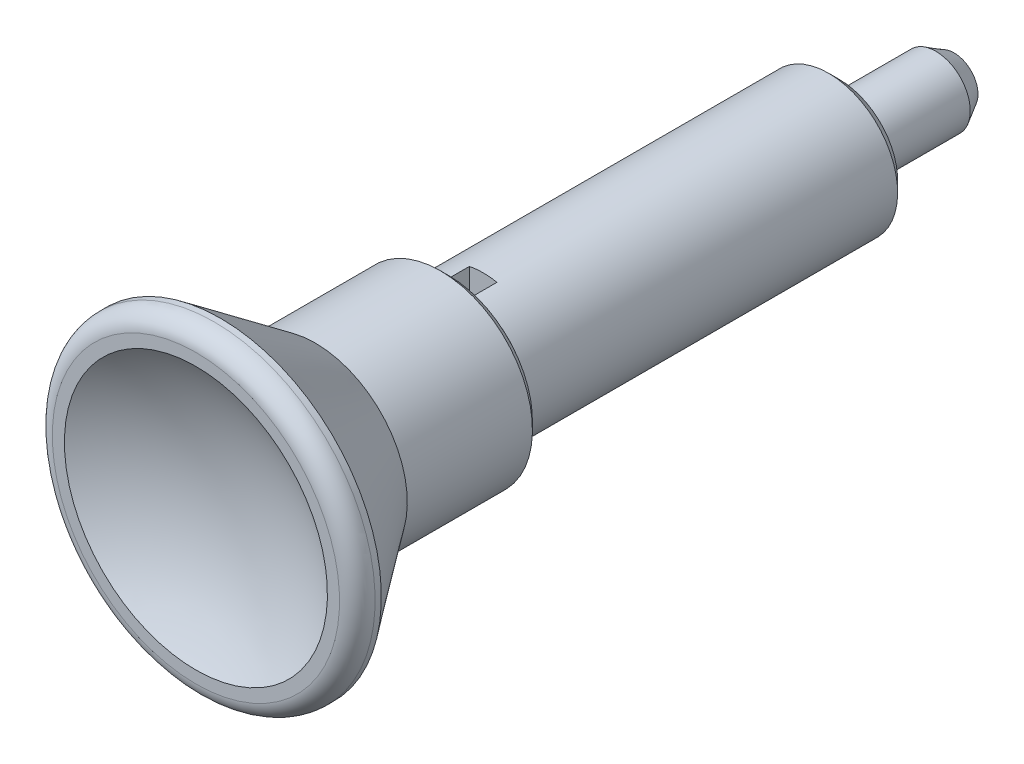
ISO-10303-21;
HEADER;
FILE_DESCRIPTION(('STEP AP214'),'2;1');
FILE_NAME('part.step','',(''),(''),'','','');
FILE_SCHEMA(('AUTOMOTIVE_DESIGN { 1 0 10303 214 1 1 1 1 }'));
ENDSEC;
DATA;
#1=APPLICATION_CONTEXT('core data for automotive mechanical design processes');
#2=APPLICATION_PROTOCOL_DEFINITION('international standard','automotive_design',2000,#1);
#3=PRODUCT_CONTEXT('',#1,'mechanical');
#4=PRODUCT('Part','Part','',(#3));
#5=PRODUCT_RELATED_PRODUCT_CATEGORY('part','',(#4));
#6=PRODUCT_DEFINITION_FORMATION('','',#4);
#7=PRODUCT_DEFINITION_CONTEXT('part definition',#1,'design');
#8=PRODUCT_DEFINITION('design','',#6,#7);
#9=PRODUCT_DEFINITION_SHAPE('','',#8);
#10=(LENGTH_UNIT() NAMED_UNIT(*) SI_UNIT(.MILLI.,.METRE.));
#11=(NAMED_UNIT(*) PLANE_ANGLE_UNIT() SI_UNIT($,.RADIAN.));
#12=(NAMED_UNIT(*) SI_UNIT($,.STERADIAN.) SOLID_ANGLE_UNIT());
#13=UNCERTAINTY_MEASURE_WITH_UNIT(LENGTH_MEASURE(1.E-05),#10,'distance_accuracy_value','');
#14=(GEOMETRIC_REPRESENTATION_CONTEXT(3) GLOBAL_UNCERTAINTY_ASSIGNED_CONTEXT((#13)) GLOBAL_UNIT_ASSIGNED_CONTEXT((#10,
#11,#12)) REPRESENTATION_CONTEXT('',''));
#15=CARTESIAN_POINT('',(0.,0.,0.));
#16=DIRECTION('',(0.,0.,1.));
#17=DIRECTION('',(1.,0.,0.));
#18=AXIS2_PLACEMENT_3D('',#15,#16,#17);
#19=CARTESIAN_POINT('',(0.6,8.,15.5));
#20=DIRECTION('',(0.,0.,1.));
#21=DIRECTION('',(0.,1.,0.));
#22=AXIS2_PLACEMENT_3D('',#19,#20,#21);
#23=PLANE('',#22);
#24=DIRECTION('',(0.,-1.,0.));
#25=VECTOR('',#24,1.);
#26=CARTESIAN_POINT('',(0.6,8.,15.5));
#27=LINE('',#26,#25);
#28=CARTESIAN_POINT('',(0.6,2.93938769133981,15.5));
#29=VERTEX_POINT('',#28);
#30=CARTESIAN_POINT('',(0.6,1.37477270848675,15.5));
#31=VERTEX_POINT('',#30);
#32=EDGE_CURVE('E83',#29,#31,#27,.T.);
#33=ORIENTED_EDGE('',*,*,#32,.F.);
#34=CARTESIAN_POINT('',(0.,0.,15.5));
#35=DIRECTION('',(0.,0.,1.));
#36=DIRECTION('',(0.,1.,0.));
#37=AXIS2_PLACEMENT_3D('',#34,#35,#36);
#38=CIRCLE('',#37,3.);
#39=CARTESIAN_POINT('',(-0.6,2.93938769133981,15.5));
#40=VERTEX_POINT('',#39);
#41=EDGE_CURVE('E77',#40,#29,#38,.F.);
#42=ORIENTED_EDGE('',*,*,#41,.F.);
#43=DIRECTION('',(0.,1.,0.));
#44=VECTOR('',#43,1.);
#45=CARTESIAN_POINT('',(-0.6,8.,15.5));
#46=LINE('',#45,#44);
#47=CARTESIAN_POINT('',(-0.6,1.37477270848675,15.5));
#48=VERTEX_POINT('',#47);
#49=EDGE_CURVE('E80',#48,#40,#46,.T.);
#50=ORIENTED_EDGE('',*,*,#49,.F.);
#51=CARTESIAN_POINT('',(0.,0.,15.5));
#52=DIRECTION('',(0.,0.,1.));
#53=DIRECTION('',(0.,1.,0.));
#54=AXIS2_PLACEMENT_3D('',#51,#52,#53);
#55=CIRCLE('',#54,1.5);
#56=EDGE_CURVE('E102',#31,#48,#55,.T.);
#57=ORIENTED_EDGE('',*,*,#56,.F.);
#58=EDGE_LOOP('',(#33,#42,#50,#57));
#59=FACE_BOUND('',#58,.T.);
#60=ADVANCED_FACE('F14',(#59),#23,.T.);
#61=CARTESIAN_POINT('',(0.6,8.,15.5));
#62=DIRECTION('',(0.,0.,1.));
#63=DIRECTION('',(0.,1.,0.));
#64=AXIS2_PLACEMENT_3D('',#61,#62,#63);
#65=PLANE('',#64);
#66=DIRECTION('',(0.,1.,0.));
#67=VECTOR('',#66,1.);
#68=CARTESIAN_POINT('',(-0.6,8.,15.5));
#69=LINE('',#68,#67);
#70=CARTESIAN_POINT('',(-0.6,-2.93938769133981,15.5));
#71=VERTEX_POINT('',#70);
#72=CARTESIAN_POINT('',(-0.6,-1.37477270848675,15.5));
#73=VERTEX_POINT('',#72);
#74=EDGE_CURVE('E210',#71,#73,#69,.T.);
#75=ORIENTED_EDGE('',*,*,#74,.F.);
#76=CARTESIAN_POINT('',(0.,0.,15.5));
#77=DIRECTION('',(0.,0.,1.));
#78=DIRECTION('',(0.,1.,0.));
#79=AXIS2_PLACEMENT_3D('',#76,#77,#78);
#80=CIRCLE('',#79,3.);
#81=CARTESIAN_POINT('',(0.6,-2.93938769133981,15.5));
#82=VERTEX_POINT('',#81);
#83=EDGE_CURVE('E86',#82,#71,#80,.F.);
#84=ORIENTED_EDGE('',*,*,#83,.F.);
#85=DIRECTION('',(0.,-1.,0.));
#86=VECTOR('',#85,1.);
#87=CARTESIAN_POINT('',(0.6,8.,15.5));
#88=LINE('',#87,#86);
#89=CARTESIAN_POINT('',(0.6,-1.37477270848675,15.5));
#90=VERTEX_POINT('',#89);
#91=EDGE_CURVE('E228',#90,#82,#88,.T.);
#92=ORIENTED_EDGE('',*,*,#91,.F.);
#93=CARTESIAN_POINT('',(0.,0.,15.5));
#94=DIRECTION('',(0.,0.,1.));
#95=DIRECTION('',(0.,1.,0.));
#96=AXIS2_PLACEMENT_3D('',#93,#94,#95);
#97=CIRCLE('',#96,1.5);
#98=EDGE_CURVE('E214',#73,#90,#97,.T.);
#99=ORIENTED_EDGE('',*,*,#98,.F.);
#100=EDGE_LOOP('',(#75,#84,#92,#99));
#101=FACE_BOUND('',#100,.T.);
#102=ADVANCED_FACE('F253',(#101),#65,.T.);
#103=CARTESIAN_POINT('',(0.,0.,0.));
#104=DIRECTION('',(0.,0.,1.));
#105=DIRECTION('',(0.,1.,0.));
#106=AXIS2_PLACEMENT_3D('',#103,#104,#105);
#107=CYLINDRICAL_SURFACE('',#106,3.);
#108=DIRECTION('',(0.,0.,1.));
#109=VECTOR('',#108,1.);
#110=CARTESIAN_POINT('',(0.6,-2.93938769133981,17.));
#111=LINE('',#110,#109);
#112=CARTESIAN_POINT('',(0.6,-2.93938769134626,16.5400000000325));
#113=VERTEX_POINT('',#112);
#114=EDGE_CURVE('E231',#82,#113,#111,.T.);
#115=ORIENTED_EDGE('',*,*,#114,.F.);
#116=ORIENTED_EDGE('',*,*,#83,.T.);
#117=DIRECTION('',(0.,0.,1.));
#118=VECTOR('',#117,1.);
#119=CARTESIAN_POINT('',(-0.6,-2.93938769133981,15.5));
#120=LINE('',#119,#118);
#121=CARTESIAN_POINT('',(-0.6,-2.93938769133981,16.5400000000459));
#122=VERTEX_POINT('',#121);
#123=EDGE_CURVE('E209',#122,#71,#120,.F.);
#124=ORIENTED_EDGE('',*,*,#123,.F.);
#125=CARTESIAN_POINT('',(0.,0.,16.5400000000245));
#126=DIRECTION('',(0.,0.,-1.));
#127=DIRECTION('',(0.,-1.,0.));
#128=AXIS2_PLACEMENT_3D('',#125,#126,#127);
#129=CIRCLE('',#128,2.99999999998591);
#130=CARTESIAN_POINT('',(-0.6,2.93938769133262,16.5400000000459));
#131=VERTEX_POINT('',#130);
#132=EDGE_CURVE('E98',#131,#122,#129,.F.);
#133=ORIENTED_EDGE('',*,*,#132,.F.);
#134=DIRECTION('',(0.,0.,1.));
#135=VECTOR('',#134,1.);
#136=CARTESIAN_POINT('',(-0.6,2.93938769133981,15.5));
#137=LINE('',#136,#135);
#138=EDGE_CURVE('E91',#40,#131,#137,.T.);
#139=ORIENTED_EDGE('',*,*,#138,.F.);
#140=ORIENTED_EDGE('',*,*,#41,.T.);
#141=DIRECTION('',(0.,0.,1.));
#142=VECTOR('',#141,1.);
#143=CARTESIAN_POINT('',(0.6,2.93938769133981,17.));
#144=LINE('',#143,#142);
#145=CARTESIAN_POINT('',(0.6,2.93938769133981,16.5400000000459));
#146=VERTEX_POINT('',#145);
#147=EDGE_CURVE('E219',#146,#29,#144,.F.);
#148=ORIENTED_EDGE('',*,*,#147,.F.);
#149=CARTESIAN_POINT('',(0.,0.,16.5400000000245));
#150=DIRECTION('',(0.,0.,-1.));
#151=DIRECTION('',(0.,-1.,0.));
#152=AXIS2_PLACEMENT_3D('',#149,#150,#151);
#153=CIRCLE('',#152,2.99999999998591);
#154=EDGE_CURVE('E233',#113,#146,#153,.F.);
#155=ORIENTED_EDGE('',*,*,#154,.F.);
#156=EDGE_LOOP('',(#115,#116,#124,#133,#139,#140,#148,#155));
#157=FACE_BOUND('',#156,.T.);
#158=CARTESIAN_POINT('',(0.,0.,0.46));
#159=DIRECTION('',(0.,0.,1.));
#160=DIRECTION('',(0.,1.,0.));
#161=AXIS2_PLACEMENT_3D('',#158,#159,#160);
#162=CIRCLE('',#161,3.);
#163=CARTESIAN_POINT('',(0.,3.,0.46));
#164=VERTEX_POINT('',#163);
#165=EDGE_CURVE('E87',#164,#164,#162,.T.);
#166=ORIENTED_EDGE('',*,*,#165,.T.);
#167=EDGE_LOOP('',(#166));
#168=FACE_BOUND('',#167,.T.);
#169=ADVANCED_FACE('F93',(#157,#168),#107,.T.);
#170=CARTESIAN_POINT('',(-0.6,8.,15.5));
#171=DIRECTION('',(1.,0.,0.));
#172=DIRECTION('',(0.,1.,0.));
#173=AXIS2_PLACEMENT_3D('',#170,#171,#172);
#174=PLANE('',#173);
#175=ORIENTED_EDGE('',*,*,#138,.T.);
#176=CARTESIAN_POINT('',(-0.6,2.46811669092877,17.0000000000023));
#177=CARTESIAN_POINT('',(-0.6,2.54681970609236,16.9234950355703));
#178=CARTESIAN_POINT('',(-0.6,2.62544380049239,16.8469092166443));
#179=CARTESIAN_POINT('',(-0.6,2.78253413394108,16.6935758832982));
#180=CARTESIAN_POINT('',(-0.6,2.86100037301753,16.6168283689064));
#181=CARTESIAN_POINT('',(-0.6,2.9393876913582,16.5400000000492));
#182=B_SPLINE_CURVE_WITH_KNOTS('',3,(#176,#177,#178,#179,#180,#181),.UNSPECIFIED.,.F.,.F.,(4,2,
4),(0.,0.329278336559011,0.658556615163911),.UNSPECIFIED.);
#183=CARTESIAN_POINT('',(-0.6,2.46811669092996,17.0000000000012));
#184=VERTEX_POINT('',#183);
#185=EDGE_CURVE('E222',#184,#131,#182,.T.);
#186=ORIENTED_EDGE('',*,*,#185,.F.);
#187=DIRECTION('',(0.,1.,0.));
#188=VECTOR('',#187,1.);
#189=CARTESIAN_POINT('',(-0.6,0.,17.));
#190=LINE('',#189,#188);
#191=CARTESIAN_POINT('',(-0.6,1.37477270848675,17.));
#192=VERTEX_POINT('',#191);
#193=EDGE_CURVE('E204',#184,#192,#190,.F.);
#194=ORIENTED_EDGE('',*,*,#193,.T.);
#195=DIRECTION('',(0.,0.,1.));
#196=VECTOR('',#195,1.);
#197=CARTESIAN_POINT('',(-0.6,1.37477270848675,-5.));
#198=LINE('',#197,#196);
#199=EDGE_CURVE('E107',#48,#192,#198,.T.);
#200=ORIENTED_EDGE('',*,*,#199,.F.);
#201=ORIENTED_EDGE('',*,*,#49,.T.);
#202=EDGE_LOOP('',(#175,#186,#194,#200,#201));
#203=FACE_BOUND('',#202,.T.);
#204=ADVANCED_FACE('F104',(#203),#174,.T.);
#205=CARTESIAN_POINT('',(0.,0.,-5.));
#206=DIRECTION('',(0.,0.,1.));
#207=DIRECTION('',(0.,1.,0.));
#208=AXIS2_PLACEMENT_3D('',#205,#206,#207);
#209=CYLINDRICAL_SURFACE('',#208,1.5);
#210=ORIENTED_EDGE('',*,*,#199,.T.);
#211=CARTESIAN_POINT('',(0.,0.,17.));
#212=DIRECTION('',(0.,0.,1.));
#213=DIRECTION('',(0.,1.,0.));
#214=AXIS2_PLACEMENT_3D('',#211,#212,#213);
#215=CIRCLE('',#214,1.5);
#216=CARTESIAN_POINT('',(0.6,1.37477270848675,17.));
#217=VERTEX_POINT('',#216);
#218=EDGE_CURVE('E203',#192,#217,#215,.F.);
#219=ORIENTED_EDGE('',*,*,#218,.T.);
#220=DIRECTION('',(0.,0.,1.));
#221=VECTOR('',#220,1.);
#222=CARTESIAN_POINT('',(0.6,1.37477270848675,17.));
#223=LINE('',#222,#221);
#224=EDGE_CURVE('E216',#31,#217,#223,.T.);
#225=ORIENTED_EDGE('',*,*,#224,.F.);
#226=ORIENTED_EDGE('',*,*,#56,.T.);
#227=EDGE_LOOP('',(#210,#219,#225,#226));
#228=FACE_BOUND('',#227,.T.);
#229=ADVANCED_FACE('F281',(#228),#209,.T.);
#230=CARTESIAN_POINT('',(0.6,8.,17.));
#231=DIRECTION('',(-1.,0.,0.));
#232=DIRECTION('',(0.,-1.,0.));
#233=AXIS2_PLACEMENT_3D('',#230,#231,#232);
#234=PLANE('',#233);
#235=CARTESIAN_POINT('',(0.6,2.93938769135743,16.54000000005));
#236=CARTESIAN_POINT('',(0.6,2.8610003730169,16.6168283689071));
#237=CARTESIAN_POINT('',(0.6,2.78253413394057,16.6935758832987));
#238=CARTESIAN_POINT('',(0.6,2.62544380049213,16.8469092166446));
#239=CARTESIAN_POINT('',(0.6,2.54681970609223,16.9234950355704));
#240=CARTESIAN_POINT('',(0.6,2.46811669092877,17.0000000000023));
#241=B_SPLINE_CURVE_WITH_KNOTS('',3,(#235,#236,#237,#238,#239,#240),.UNSPECIFIED.,.F.,.F.,(4,2,
4),(0.,0.329278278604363,0.658556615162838),.UNSPECIFIED.);
#242=CARTESIAN_POINT('',(0.6,2.46811669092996,17.0000000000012));
#243=VERTEX_POINT('',#242);
#244=EDGE_CURVE('E232',#146,#243,#241,.T.);
#245=ORIENTED_EDGE('',*,*,#244,.F.);
#246=ORIENTED_EDGE('',*,*,#147,.T.);
#247=ORIENTED_EDGE('',*,*,#32,.T.);
#248=ORIENTED_EDGE('',*,*,#224,.T.);
#249=DIRECTION('',(0.,1.,0.));
#250=VECTOR('',#249,1.);
#251=CARTESIAN_POINT('',(0.6,0.,17.));
#252=LINE('',#251,#250);
#253=EDGE_CURVE('E201',#217,#243,#252,.T.);
#254=ORIENTED_EDGE('',*,*,#253,.T.);
#255=EDGE_LOOP('',(#245,#246,#247,#248,#254));
#256=FACE_BOUND('',#255,.T.);
#257=ADVANCED_FACE('F239',(#256),#234,.T.);
#258=CARTESIAN_POINT('',(0.,0.,16.5399999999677));
#259=DIRECTION('',(0.,0.,-1.));
#260=DIRECTION('',(0.,-1.,0.));
#261=AXIS2_PLACEMENT_3D('',#258,#259,#260);
#262=CONICAL_SURFACE('',#261,3.00000000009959,0.785398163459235);
#263=ORIENTED_EDGE('',*,*,#244,.T.);
#264=CARTESIAN_POINT('',(0.,0.,17.));
#265=DIRECTION('',(0.,0.,-1.));
#266=DIRECTION('',(0.,-1.,0.));
#267=AXIS2_PLACEMENT_3D('',#264,#265,#266);
#268=CIRCLE('',#267,2.54000000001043);
#269=CARTESIAN_POINT('',(0.6,-2.46811669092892,17.0000000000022));
#270=VERTEX_POINT('',#269);
#271=EDGE_CURVE('E200',#243,#270,#268,.T.);
#272=ORIENTED_EDGE('',*,*,#271,.T.);
#273=CARTESIAN_POINT('',(0.599999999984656,-2.93938769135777,16.540000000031));
#274=CARTESIAN_POINT('',(0.599999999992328,-2.86100037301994,16.6168283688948));
#275=CARTESIAN_POINT('',(0.599999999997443,-2.78253413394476,16.6935758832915));
#276=CARTESIAN_POINT('',(0.600000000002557,-2.62544380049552,16.8469092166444));
#277=CARTESIAN_POINT('',(0.600000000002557,-2.54681970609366,16.9234950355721));
#278=CARTESIAN_POINT('',(0.6,-2.46811669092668,17.0000000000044));
#279=B_SPLINE_CURVE_WITH_KNOTS('',3,(#273,#274,#275,#276,#277,#278),.UNSPECIFIED.,.F.,.F.,(4,2,
4),(0.,0.32927827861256,0.658556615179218),.UNSPECIFIED.);
#280=EDGE_CURVE('E215',#113,#270,#279,.T.);
#281=ORIENTED_EDGE('',*,*,#280,.F.);
#282=ORIENTED_EDGE('',*,*,#154,.T.);
#283=EDGE_LOOP('',(#263,#272,#281,#282));
#284=FACE_BOUND('',#283,.T.);
#285=ADVANCED_FACE('F244',(#284),#262,.T.);
#286=CARTESIAN_POINT('',(0.6,8.,17.));
#287=DIRECTION('',(-1.,0.,0.));
#288=DIRECTION('',(0.,-1.,0.));
#289=AXIS2_PLACEMENT_3D('',#286,#287,#288);
#290=PLANE('',#289);
#291=ORIENTED_EDGE('',*,*,#114,.T.);
#292=ORIENTED_EDGE('',*,*,#280,.T.);
#293=DIRECTION('',(0.,1.,0.));
#294=VECTOR('',#293,1.);
#295=CARTESIAN_POINT('',(0.6,0.,17.));
#296=LINE('',#295,#294);
#297=CARTESIAN_POINT('',(0.6,-1.37477270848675,17.));
#298=VERTEX_POINT('',#297);
#299=EDGE_CURVE('E197',#270,#298,#296,.T.);
#300=ORIENTED_EDGE('',*,*,#299,.T.);
#301=DIRECTION('',(0.,0.,1.));
#302=VECTOR('',#301,1.);
#303=CARTESIAN_POINT('',(0.6,-1.37477270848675,-5.));
#304=LINE('',#303,#302);
#305=EDGE_CURVE('E211',#90,#298,#304,.T.);
#306=ORIENTED_EDGE('',*,*,#305,.F.);
#307=ORIENTED_EDGE('',*,*,#91,.T.);
#308=EDGE_LOOP('',(#291,#292,#300,#306,#307));
#309=FACE_BOUND('',#308,.T.);
#310=ADVANCED_FACE('F249',(#309),#290,.T.);
#311=CARTESIAN_POINT('',(0.,0.,-5.));
#312=DIRECTION('',(0.,0.,1.));
#313=DIRECTION('',(0.,1.,0.));
#314=AXIS2_PLACEMENT_3D('',#311,#312,#313);
#315=CYLINDRICAL_SURFACE('',#314,1.5);
#316=DIRECTION('',(0.,0.,1.));
#317=VECTOR('',#316,1.);
#318=CARTESIAN_POINT('',(-0.6,-1.37477270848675,15.5));
#319=LINE('',#318,#317);
#320=CARTESIAN_POINT('',(-0.6,-1.37477270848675,17.));
#321=VERTEX_POINT('',#320);
#322=EDGE_CURVE('E207',#73,#321,#319,.T.);
#323=ORIENTED_EDGE('',*,*,#322,.F.);
#324=ORIENTED_EDGE('',*,*,#98,.T.);
#325=ORIENTED_EDGE('',*,*,#305,.T.);
#326=CARTESIAN_POINT('',(0.,0.,17.));
#327=DIRECTION('',(0.,0.,1.));
#328=DIRECTION('',(0.,1.,0.));
#329=AXIS2_PLACEMENT_3D('',#326,#327,#328);
#330=CIRCLE('',#329,1.5);
#331=EDGE_CURVE('E196',#298,#321,#330,.F.);
#332=ORIENTED_EDGE('',*,*,#331,.T.);
#333=EDGE_LOOP('',(#323,#324,#325,#332));
#334=FACE_BOUND('',#333,.T.);
#335=ADVANCED_FACE('F422',(#334),#315,.T.);
#336=CARTESIAN_POINT('',(-0.6,8.,15.5));
#337=DIRECTION('',(1.,0.,0.));
#338=DIRECTION('',(0.,1.,0.));
#339=AXIS2_PLACEMENT_3D('',#336,#337,#338);
#340=PLANE('',#339);
#341=CARTESIAN_POINT('',(-0.6,-2.9393876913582,16.5400000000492));
#342=CARTESIAN_POINT('',(-0.6,-2.86100037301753,16.6168283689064));
#343=CARTESIAN_POINT('',(-0.6,-2.78253413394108,16.6935758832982));
#344=CARTESIAN_POINT('',(-0.6,-2.62544380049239,16.8469092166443));
#345=CARTESIAN_POINT('',(-0.6,-2.54681970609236,16.9234950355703));
#346=CARTESIAN_POINT('',(-0.6,-2.46811669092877,17.0000000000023));
#347=B_SPLINE_CURVE_WITH_KNOTS('',3,(#341,#342,#343,#344,#345,#346),.UNSPECIFIED.,.F.,.F.,(4,2,
4),(0.,0.329278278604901,0.658556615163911),.UNSPECIFIED.);
#348=CARTESIAN_POINT('',(-0.6,-2.46811669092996,17.0000000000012));
#349=VERTEX_POINT('',#348);
#350=EDGE_CURVE('E225',#122,#349,#347,.T.);
#351=ORIENTED_EDGE('',*,*,#350,.F.);
#352=ORIENTED_EDGE('',*,*,#123,.T.);
#353=ORIENTED_EDGE('',*,*,#74,.T.);
#354=ORIENTED_EDGE('',*,*,#322,.T.);
#355=DIRECTION('',(0.,1.,0.));
#356=VECTOR('',#355,1.);
#357=CARTESIAN_POINT('',(-0.6,0.,17.));
#358=LINE('',#357,#356);
#359=EDGE_CURVE('E33',#321,#349,#358,.F.);
#360=ORIENTED_EDGE('',*,*,#359,.T.);
#361=EDGE_LOOP('',(#351,#352,#353,#354,#360));
#362=FACE_BOUND('',#361,.T.);
#363=ADVANCED_FACE('F255',(#362),#340,.T.);
#364=CARTESIAN_POINT('',(0.,0.,16.5399999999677));
#365=DIRECTION('',(0.,0.,-1.));
#366=DIRECTION('',(0.,-1.,0.));
#367=AXIS2_PLACEMENT_3D('',#364,#365,#366);
#368=CONICAL_SURFACE('',#367,3.00000000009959,0.785398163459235);
#369=ORIENTED_EDGE('',*,*,#185,.T.);
#370=ORIENTED_EDGE('',*,*,#132,.T.);
#371=ORIENTED_EDGE('',*,*,#350,.T.);
#372=CARTESIAN_POINT('',(0.,0.,17.));
#373=DIRECTION('',(0.,0.,-1.));
#374=DIRECTION('',(0.,-1.,0.));
#375=AXIS2_PLACEMENT_3D('',#372,#373,#374);
#376=CIRCLE('',#375,2.54000000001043);
#377=EDGE_CURVE('E141',#349,#184,#376,.T.);
#378=ORIENTED_EDGE('',*,*,#377,.T.);
#379=EDGE_LOOP('',(#369,#370,#371,#378));
#380=FACE_BOUND('',#379,.T.);
#381=ADVANCED_FACE('F163',(#380),#368,.T.);
#382=CARTESIAN_POINT('',(0.,0.,36.2));
#383=DIRECTION('',(1.,0.,0.));
#384=DIRECTION('',(0.,-1.,0.));
#385=AXIS2_PLACEMENT_3D('',#382,#383,#384);
#386=SPHERICAL_SURFACE('',#385,10.);
#387=CARTESIAN_POINT('',(0.,-5.7236352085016,28.));
#388=CARTESIAN_POINT('',(0.160807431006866,-5.72363636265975,28.));
#389=CARTESIAN_POINT('',(0.321595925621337,-5.71685551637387,28.));
#390=CARTESIAN_POINT('',(0.642083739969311,-5.68977946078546,28.));
#391=CARTESIAN_POINT('',(0.801782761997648,-5.66948069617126,28.));
#392=CARTESIAN_POINT('',(1.11904321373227,-5.61548397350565,28.));
#393=CARTESIAN_POINT('',(1.27660261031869,-5.58177408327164,28.));
#394=CARTESIAN_POINT('',(1.58837766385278,-5.50118075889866,28.));
#395=CARTESIAN_POINT('',(1.7425920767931,-5.45429251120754,28.));
#396=CARTESIAN_POINT('',(2.04639002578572,-5.34772649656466,28.));
#397=CARTESIAN_POINT('',(2.1959773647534,-5.28805957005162,28.));
#398=CARTESIAN_POINT('',(2.48964848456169,-5.1563126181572,28.));
#399=CARTESIAN_POINT('',(2.63373021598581,-5.08422802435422,28.));
#400=CARTESIAN_POINT('',(2.91521966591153,-4.9282219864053,28.));
#401=CARTESIAN_POINT('',(3.05263145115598,-4.84430787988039,28.));
#402=CARTESIAN_POINT('',(3.31994934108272,-4.6651723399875,28.));
#403=CARTESIAN_POINT('',(3.44985265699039,-4.56994674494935,28.));
#404=CARTESIAN_POINT('',(3.70114169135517,-4.36891670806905,28.));
#405=CARTESIAN_POINT('',(3.82252965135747,-4.26311506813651,28.));
#406=CARTESIAN_POINT('',(4.05600625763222,-4.04162285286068,28.));
#407=CARTESIAN_POINT('',(4.16809145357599,-3.92592864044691,28.));
#408=CARTESIAN_POINT('',(4.38207998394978,-3.68554745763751,28.));
#409=CARTESIAN_POINT('',(4.48398666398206,-3.56086346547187,28.));
#410=CARTESIAN_POINT('',(4.6769716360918,-3.30330749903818,28.));
#411=CARTESIAN_POINT('',(4.76804591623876,-3.17043251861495,28.));
#412=CARTESIAN_POINT('',(4.93864148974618,-2.897534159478,28.));
#413=CARTESIAN_POINT('',(5.01816724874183,-2.75751357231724,28.));
#414=CARTESIAN_POINT('',(5.16516989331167,-2.47121903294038,28.));
#415=CARTESIAN_POINT('',(5.2326423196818,-2.32494279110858,28.));
#416=CARTESIAN_POINT('',(5.35499943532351,-2.02727986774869,28.));
#417=CARTESIAN_POINT('',(5.40988878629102,-1.87589510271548,28.));
#418=CARTESIAN_POINT('',(5.50674021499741,-1.56898679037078,28.));
#419=CARTESIAN_POINT('',(5.54869751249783,-1.41346173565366,28.));
#420=CARTESIAN_POINT('',(5.61934383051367,-1.09947530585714,28.));
#421=CARTESIAN_POINT('',(5.64803771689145,-0.941015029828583,28.));
#422=CARTESIAN_POINT('',(5.69199213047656,-0.622226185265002,28.));
#423=CARTESIAN_POINT('',(5.70724769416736,-0.461896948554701,28.));
#424=CARTESIAN_POINT('',(5.73261157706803,0.0200663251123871,28.));
#425=CARTESIAN_POINT('',(5.72239370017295,0.343017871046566,28.));
#426=CARTESIAN_POINT('',(5.64788102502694,0.982445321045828,28.));
#427=CARTESIAN_POINT('',(5.58358620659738,1.2989212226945,28.));
#428=CARTESIAN_POINT('',(5.4027781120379,1.91663457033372,28.));
#429=CARTESIAN_POINT('',(5.28626478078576,2.21787200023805,28.));
#430=CARTESIAN_POINT('',(5.00431820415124,2.79649753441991,28.));
#431=CARTESIAN_POINT('',(4.83888497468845,3.07388564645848,28.));
#432=CARTESIAN_POINT('',(4.46379723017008,3.59695416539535,28.));
#433=CARTESIAN_POINT('',(4.25414273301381,3.84263458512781,28.));
#434=CARTESIAN_POINT('',(3.79656321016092,4.29530949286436,28.));
#435=CARTESIAN_POINT('',(3.54863817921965,4.50230397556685,28.));
#436=CARTESIAN_POINT('',(3.02155560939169,4.87173216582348,28.));
#437=CARTESIAN_POINT('',(2.74239806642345,5.03416586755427,28.));
#438=CARTESIAN_POINT('',(2.16077492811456,5.30986113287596,28.));
#439=CARTESIAN_POINT('',(1.85830933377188,5.42312269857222,28.));
#440=CARTESIAN_POINT('',(1.23865621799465,5.59725861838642,28.));
#441=CARTESIAN_POINT('',(0.921468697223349,5.65813297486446,28.));
#442=CARTESIAN_POINT('',(0.281375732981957,5.72576641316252,28.));
#443=CARTESIAN_POINT('',(-0.0415297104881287,5.73252549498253,28.));
#444=CARTESIAN_POINT('',(-0.683892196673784,5.69173654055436,28.));
#445=CARTESIAN_POINT('',(-1.003349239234,5.64418850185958,28.));
#446=CARTESIAN_POINT('',(-1.62974648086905,5.496134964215,28.));
#447=CARTESIAN_POINT('',(-1.93668667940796,5.39562946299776,28.));
#448=CARTESIAN_POINT('',(-2.5293370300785,5.1445143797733,28.));
#449=CARTESIAN_POINT('',(-2.81504718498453,4.99390480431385,28.));
#450=CARTESIAN_POINT('',(-3.35712705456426,4.64685580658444,28.));
#451=CARTESIAN_POINT('',(-3.61349677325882,4.45041639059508,28.));
#452=CARTESIAN_POINT('',(-4.08961807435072,4.01728823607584,28.));
#453=CARTESIAN_POINT('',(-4.30936964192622,3.78059948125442,28.));
#454=CARTESIAN_POINT('',(-4.70601744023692,3.27367551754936,28.));
#455=CARTESIAN_POINT('',(-4.88291365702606,3.00344029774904,28.));
#456=CARTESIAN_POINT('',(-5.18882533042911,2.43715468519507,28.));
#457=CARTESIAN_POINT('',(-5.31784083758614,2.14110431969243,28.));
#458=CARTESIAN_POINT('',(-5.52434238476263,1.53136936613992,28.));
#459=CARTESIAN_POINT('',(-5.60182844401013,1.21768478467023,28.));
#460=CARTESIAN_POINT('',(-5.67775041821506,0.741063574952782,28.));
#461=CARTESIAN_POINT('',(-5.69633902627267,0.581086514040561,28.));
#462=CARTESIAN_POINT('',(-5.71997908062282,0.260151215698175,28.));
#463=CARTESIAN_POINT('',(-5.72503552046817,0.099193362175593,28.));
#464=CARTESIAN_POINT('',(-5.72156943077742,-0.222623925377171,28.));
#465=CARTESIAN_POINT('',(-5.71304191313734,-0.383483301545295,28.));
#466=CARTESIAN_POINT('',(-5.68247012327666,-0.703855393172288,28.));
#467=CARTESIAN_POINT('',(-5.66043084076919,-0.863368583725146,28.));
#468=CARTESIAN_POINT('',(-5.60298439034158,-1.18002989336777,28.));
#469=CARTESIAN_POINT('',(-5.56757226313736,-1.33717711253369,28.));
#470=CARTESIAN_POINT('',(-5.48364862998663,-1.64787176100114,28.));
#471=CARTESIAN_POINT('',(-5.43514196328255,-1.80142049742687,28.));
#472=CARTESIAN_POINT('',(-5.32534671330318,-2.10394548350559,28.));
#473=CARTESIAN_POINT('',(-5.26405317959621,-2.25291993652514,28.));
#474=CARTESIAN_POINT('',(-5.12915652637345,-2.54512049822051,28.));
#475=CARTESIAN_POINT('',(-5.05555795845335,-2.68834870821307,28.));
#476=CARTESIAN_POINT('',(-4.89653218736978,-2.96814329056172,28.));
#477=CARTESIAN_POINT('',(-4.81110109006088,-3.10470744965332,28.));
#478=CARTESIAN_POINT('',(-4.62906996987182,-3.37010300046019,28.));
#479=CARTESIAN_POINT('',(-4.53247408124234,-3.49893722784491,28.));
#480=CARTESIAN_POINT('',(-4.32874747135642,-3.74804508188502,28.));
#481=CARTESIAN_POINT('',(-4.22161397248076,-3.86831643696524,28.));
#482=CARTESIAN_POINT('',(-3.99763671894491,-4.0993631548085,28.));
#483=CARTESIAN_POINT('',(-3.88079656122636,-4.21014200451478,28.));
#484=CARTESIAN_POINT('',(-3.63812684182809,-4.42153169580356,28.));
#485=CARTESIAN_POINT('',(-3.51229176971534,-4.52213621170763,28.));
#486=CARTESIAN_POINT('',(-3.25263946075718,-4.71234836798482,28.));
#487=CARTESIAN_POINT('',(-3.11882518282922,-4.80196004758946,28.));
#488=CARTESIAN_POINT('',(-2.84400709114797,-4.96966373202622,28.));
#489=CARTESIAN_POINT('',(-2.70299729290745,-5.04774593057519,28.));
#490=CARTESIAN_POINT('',(-2.41495020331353,-5.19171760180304,28.));
#491=CARTESIAN_POINT('',(-2.26791513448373,-5.25761152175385,28.));
#492=CARTESIAN_POINT('',(-1.96894533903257,-5.37672030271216,28.));
#493=CARTESIAN_POINT('',(-1.81701509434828,-5.42994640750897,28.));
#494=CARTESIAN_POINT('',(-1.50926303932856,-5.5234034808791,28.));
#495=CARTESIAN_POINT('',(-1.35344226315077,-5.56363786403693,28.));
#496=CARTESIAN_POINT('',(-0.999794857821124,-5.63921310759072,28.));
#497=CARTESIAN_POINT('',(-0.801164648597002,-5.67084452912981,28.));
#498=CARTESIAN_POINT('',(-0.401679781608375,-5.7130548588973,28.));
#499=CARTESIAN_POINT('',(-0.200825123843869,-5.72363376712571,28.));
#500=CARTESIAN_POINT('',(0.,-5.7236352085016,28.));
#501=B_SPLINE_CURVE_WITH_KNOTS('',3,(#387,#388,#389,#390,#391,#392,#393,#394,#395,#396,#397,
#398,#399,#400,#401,#402,#403,#404,#405,#406,#407,#408,#409,#410,#411,#412,#413,#414,#415,#416,
#417,#418,#419,#420,#421,#422,#423,#424,#425,#426,#427,#428,#429,#430,#431,#432,#433,#434,#435,
#436,#437,#438,#439,#440,#441,#442,#443,#444,#445,#446,#447,#448,#449,#450,#451,#452,#453,#454,
#455,#456,#457,#458,#459,#460,#461,#462,#463,#464,#465,#466,#467,#468,#469,#470,#471,#472,#473,
#474,#475,#476,#477,#478,#479,#480,#481,#482,#483,#484,#485,#486,#487,#488,#489,#490,#491,#492,
#493,#494,#495,#496,#497,#498,#499,#500),.UNSPECIFIED.,.T.,.F.,(4,2,2,2,2,2,2,2,2,2,2,2,2,2,2,2,
2,2,2,2,2,2,2,2,2,2,2,2,2,2,2,2,2,2,2,2,2,2,2,2,2,2,2,2,2,2,2,2,2,2,2,2,2,2,2,2,4),(0.,
0.482246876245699,0.964620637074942,1.44742454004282,1.93040502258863,2.41297739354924,
2.89572768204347,3.37817983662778,3.86081004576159,4.34331272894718,4.82599357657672,
5.30851524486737,5.7912150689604,6.27372774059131,6.75641855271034,7.23893025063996,
7.72162009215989,8.20413271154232,8.68682347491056,9.65116698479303,10.615510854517,
11.5798557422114,12.5442003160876,13.5085444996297,14.472888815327,15.437233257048,
16.4015776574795,17.3659220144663,18.3302663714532,19.2946107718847,20.2589552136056,
21.223299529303,22.1876437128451,23.1519882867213,24.1163331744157,25.0806770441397,
26.0450205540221,26.5277113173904,27.0102239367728,27.4929137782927,27.9754254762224,
28.4581162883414,28.9406289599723,29.4233287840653,29.905850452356,30.3885312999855,
30.8710339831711,31.3536641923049,31.8361163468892,32.3188666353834,32.8014390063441,
33.2844194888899,33.7672233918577,34.249597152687,34.7318440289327,35.334100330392,
35.9363566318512),.UNSPECIFIED.);
#502=CARTESIAN_POINT('',(0.,-5.7236352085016,28.));
#503=VERTEX_POINT('',#502);
#504=EDGE_CURVE('E133',#503,#503,#501,.T.);
#505=ORIENTED_EDGE('',*,*,#504,.T.);
#506=EDGE_LOOP('',(#505));
#507=FACE_BOUND('',#506,.T.);
#508=ADVANCED_FACE('F143',(#507),#386,.F.);
#509=CARTESIAN_POINT('',(-3.64644660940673,0.,17.));
#510=DIRECTION('',(0.,0.,1.));
#511=DIRECTION('',(0.,1.,0.));
#512=AXIS2_PLACEMENT_3D('',#509,#510,#511);
#513=PLANE('',#512);
#514=CARTESIAN_POINT('',(0.,0.,17.0000000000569));
#515=DIRECTION('',(0.,0.,1.));
#516=DIRECTION('',(0.,1.,0.));
#517=AXIS2_PLACEMENT_3D('',#514,#515,#516);
#518=CIRCLE('',#517,3.64644660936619);
#519=CARTESIAN_POINT('',(0.,3.64644660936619,17.0000000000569));
#520=VERTEX_POINT('',#519);
#521=EDGE_CURVE('E130',#520,#520,#518,.T.);
#522=ORIENTED_EDGE('',*,*,#521,.F.);
#523=EDGE_LOOP('',(#522));
#524=FACE_BOUND('',#523,.T.);
#525=ORIENTED_EDGE('',*,*,#359,.F.);
#526=ORIENTED_EDGE('',*,*,#331,.F.);
#527=ORIENTED_EDGE('',*,*,#299,.F.);
#528=ORIENTED_EDGE('',*,*,#271,.F.);
#529=ORIENTED_EDGE('',*,*,#253,.F.);
#530=ORIENTED_EDGE('',*,*,#218,.F.);
#531=ORIENTED_EDGE('',*,*,#193,.F.);
#532=ORIENTED_EDGE('',*,*,#377,.F.);
#533=EDGE_LOOP('',(#525,#526,#527,#528,#529,#530,#531,#532));
#534=FACE_BOUND('',#533,.T.);
#535=ADVANCED_FACE('F153',(#524,#534),#513,.F.);
#536=CARTESIAN_POINT('',(-5.72363520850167,0.,28.));
#537=DIRECTION('',(0.,0.,-1.));
#538=DIRECTION('',(0.,-1.,0.));
#539=AXIS2_PLACEMENT_3D('',#536,#537,#538);
#540=PLANE('',#539);
#541=ORIENTED_EDGE('',*,*,#504,.F.);
#542=EDGE_LOOP('',(#541));
#543=FACE_BOUND('',#542,.T.);
#544=CARTESIAN_POINT('',(0.,0.,28.));
#545=DIRECTION('',(0.,0.,-1.));
#546=DIRECTION('',(0.,-1.,0.));
#547=AXIS2_PLACEMENT_3D('',#544,#545,#546);
#548=CIRCLE('',#547,6.24999999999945);
#549=CARTESIAN_POINT('',(0.,-6.24999999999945,28.));
#550=VERTEX_POINT('',#549);
#551=EDGE_CURVE('E126',#550,#550,#548,.T.);
#552=ORIENTED_EDGE('',*,*,#551,.F.);
#553=EDGE_LOOP('',(#552));
#554=FACE_BOUND('',#553,.T.);
#555=ADVANCED_FACE('F148',(#543,#554),#540,.F.);
#556=CARTESIAN_POINT('',(0.,0.,17.3535533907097));
#557=DIRECTION('',(0.,0.,1.));
#558=DIRECTION('',(0.,1.,0.));
#559=AXIS2_PLACEMENT_3D('',#556,#557,#558);
#560=CONICAL_SURFACE('',#559,4.0000000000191,0.785398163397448);
#561=CARTESIAN_POINT('',(0.,0.,17.3535533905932));
#562=DIRECTION('',(0.,0.,1.));
#563=DIRECTION('',(0.,1.,0.));
#564=AXIS2_PLACEMENT_3D('',#561,#562,#563);
#565=CIRCLE('',#564,4.);
#566=CARTESIAN_POINT('',(0.,4.,17.3535533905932));
#567=VERTEX_POINT('',#566);
#568=EDGE_CURVE('E129',#567,#567,#565,.T.);
#569=ORIENTED_EDGE('',*,*,#568,.F.);
#570=EDGE_LOOP('',(#569));
#571=FACE_BOUND('',#570,.T.);
#572=ORIENTED_EDGE('',*,*,#521,.T.);
#573=EDGE_LOOP('',(#572));
#574=FACE_BOUND('',#573,.T.);
#575=ADVANCED_FACE('F152',(#571,#574),#560,.T.);
#576=CARTESIAN_POINT('',(0.,0.,27.2015640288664));
#577=DIRECTION('',(0.,0.,-1.));
#578=DIRECTION('',(0.,-1.,0.));
#579=AXIS2_PLACEMENT_3D('',#576,#577,#578);
#580=TOROIDAL_SURFACE('',#579,6.2,0.8);
#581=CARTESIAN_POINT('',(0.,0.,27.2015653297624));
#582=DIRECTION('',(0.,0.,1.));
#583=DIRECTION('',(0.,1.,0.));
#584=AXIS2_PLACEMENT_3D('',#581,#582,#583);
#585=CIRCLE('',#584,6.99999999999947);
#586=CARTESIAN_POINT('',(0.,6.99999999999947,27.2015653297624));
#587=VERTEX_POINT('',#586);
#588=EDGE_CURVE('E500',#587,#587,#585,.F.);
#589=ORIENTED_EDGE('',*,*,#588,.F.);
#590=EDGE_LOOP('',(#589));
#591=FACE_BOUND('',#590,.T.);
#592=ORIENTED_EDGE('',*,*,#551,.T.);
#593=EDGE_LOOP('',(#592));
#594=FACE_BOUND('',#593,.T.);
#595=ADVANCED_FACE('F185',(#591,#594),#580,.T.);
#596=CARTESIAN_POINT('',(0.,0.,-5.));
#597=DIRECTION('',(0.,0.,1.));
#598=DIRECTION('',(0.,1.,0.));
#599=AXIS2_PLACEMENT_3D('',#596,#597,#598);
#600=CYLINDRICAL_SURFACE('',#599,4.);
#601=CARTESIAN_POINT('',(0.,0.,22.8));
#602=DIRECTION('',(0.,0.,1.));
#603=DIRECTION('',(0.,1.,0.));
#604=AXIS2_PLACEMENT_3D('',#601,#602,#603);
#605=CIRCLE('',#604,4.);
#606=CARTESIAN_POINT('',(0.,4.,22.8));
#607=VERTEX_POINT('',#606);
#608=EDGE_CURVE('E24',#607,#607,#605,.T.);
#609=ORIENTED_EDGE('',*,*,#608,.F.);
#610=EDGE_LOOP('',(#609));
#611=FACE_BOUND('',#610,.T.);
#612=ORIENTED_EDGE('',*,*,#568,.T.);
#613=EDGE_LOOP('',(#612));
#614=FACE_BOUND('',#613,.T.);
#615=ADVANCED_FACE('F179',(#611,#614),#600,.T.);
#616=CARTESIAN_POINT('',(0.,0.,-5.));
#617=DIRECTION('',(0.,0.,1.));
#618=DIRECTION('',(0.,1.,0.));
#619=AXIS2_PLACEMENT_3D('',#616,#617,#618);
#620=CYLINDRICAL_SURFACE('',#619,6.99999999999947);
#621=ORIENTED_EDGE('',*,*,#588,.T.);
#622=EDGE_LOOP('',(#621));
#623=FACE_BOUND('',#622,.T.);
#624=CARTESIAN_POINT('',(0.,0.,26.9291457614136));
#625=DIRECTION('',(0.,0.,1.));
#626=DIRECTION('',(0.,1.,0.));
#627=AXIS2_PLACEMENT_3D('',#624,#625,#626);
#628=CIRCLE('',#627,7.);
#629=CARTESIAN_POINT('',(0.,7.,26.9291457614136));
#630=VERTEX_POINT('',#629);
#631=EDGE_CURVE('E9',#630,#630,#628,.F.);
#632=ORIENTED_EDGE('',*,*,#631,.F.);
#633=EDGE_LOOP('',(#632));
#634=FACE_BOUND('',#633,.T.);
#635=ADVANCED_FACE('F169',(#623,#634),#620,.T.);
#636=CARTESIAN_POINT('',(0.,0.,26.9291457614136));
#637=DIRECTION('',(0.,0.,1.));
#638=DIRECTION('',(0.,1.,0.));
#639=AXIS2_PLACEMENT_3D('',#636,#637,#638);
#640=CONICAL_SURFACE('',#639,7.,0.628318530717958);
#641=ORIENTED_EDGE('',*,*,#631,.T.);
#642=EDGE_LOOP('',(#641));
#643=FACE_BOUND('',#642,.T.);
#644=ORIENTED_EDGE('',*,*,#608,.T.);
#645=EDGE_LOOP('',(#644));
#646=FACE_BOUND('',#645,.T.);
#647=ADVANCED_FACE('F167',(#643,#646),#640,.T.);
#648=CARTESIAN_POINT('',(-1.03811978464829,0.,-5.));
#649=DIRECTION('',(0.,0.,1.));
#650=DIRECTION('',(0.,1.,0.));
#651=AXIS2_PLACEMENT_3D('',#648,#649,#650);
#652=PLANE('',#651);
#653=CARTESIAN_POINT('',(0.,0.,-5.0000000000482));
#654=DIRECTION('',(0.,0.,1.));
#655=DIRECTION('',(0.,1.,0.));
#656=AXIS2_PLACEMENT_3D('',#653,#654,#655);
#657=CIRCLE('',#656,1.03811978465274);
#658=CARTESIAN_POINT('',(0.,1.03811978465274,-5.0000000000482));
#659=VERTEX_POINT('',#658);
#660=EDGE_CURVE('E18',#659,#659,#657,.T.);
#661=ORIENTED_EDGE('',*,*,#660,.F.);
#662=EDGE_LOOP('',(#661));
#663=FACE_BOUND('',#662,.T.);
#664=ADVANCED_FACE('F16',(#663),#652,.F.);
#665=CARTESIAN_POINT('',(0.,0.,-4.20000000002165));
#666=DIRECTION('',(0.,0.,1.));
#667=DIRECTION('',(0.,1.,0.));
#668=AXIS2_PLACEMENT_3D('',#665,#666,#667);
#669=CONICAL_SURFACE('',#668,1.50000000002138,0.523598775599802);
#670=CARTESIAN_POINT('',(0.,0.,-4.2));
#671=DIRECTION('',(0.,0.,1.));
#672=DIRECTION('',(0.,1.,0.));
#673=AXIS2_PLACEMENT_3D('',#670,#671,#672);
#674=CIRCLE('',#673,1.5);
#675=CARTESIAN_POINT('',(0.,1.5,-4.2));
#676=VERTEX_POINT('',#675);
#677=EDGE_CURVE('E120',#676,#676,#674,.T.);
#678=ORIENTED_EDGE('',*,*,#677,.F.);
#679=EDGE_LOOP('',(#678));
#680=FACE_BOUND('',#679,.T.);
#681=ORIENTED_EDGE('',*,*,#660,.T.);
#682=EDGE_LOOP('',(#681));
#683=FACE_BOUND('',#682,.T.);
#684=ADVANCED_FACE('F177',(#680,#683),#669,.T.);
#685=CARTESIAN_POINT('',(0.,0.,-5.));
#686=DIRECTION('',(0.,0.,1.));
#687=DIRECTION('',(0.,1.,0.));
#688=AXIS2_PLACEMENT_3D('',#685,#686,#687);
#689=CYLINDRICAL_SURFACE('',#688,1.5);
#690=CARTESIAN_POINT('',(0.,0.,0.));
#691=DIRECTION('',(0.,0.,1.));
#692=DIRECTION('',(0.,1.,0.));
#693=AXIS2_PLACEMENT_3D('',#690,#691,#692);
#694=CIRCLE('',#693,1.5);
#695=CARTESIAN_POINT('',(0.,1.5,0.));
#696=VERTEX_POINT('',#695);
#697=EDGE_CURVE('E123',#696,#696,#694,.F.);
#698=ORIENTED_EDGE('',*,*,#697,.T.);
#699=EDGE_LOOP('',(#698));
#700=FACE_BOUND('',#699,.T.);
#701=ORIENTED_EDGE('',*,*,#677,.T.);
#702=EDGE_LOOP('',(#701));
#703=FACE_BOUND('',#702,.T.);
#704=ADVANCED_FACE('F296',(#700,#703),#689,.T.);
#705=CARTESIAN_POINT('',(-2.54,0.,0.));
#706=DIRECTION('',(0.,0.,1.));
#707=DIRECTION('',(0.,1.,0.));
#708=AXIS2_PLACEMENT_3D('',#705,#706,#707);
#709=PLANE('',#708);
#710=CARTESIAN_POINT('',(0.,0.,6.09373662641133E-11));
#711=DIRECTION('',(0.,0.,1.));
#712=DIRECTION('',(0.,1.,0.));
#713=AXIS2_PLACEMENT_3D('',#710,#711,#712);
#714=CIRCLE('',#713,2.53999999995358);
#715=CARTESIAN_POINT('',(0.,2.53999999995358,6.09373662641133E-11));
#716=VERTEX_POINT('',#715);
#717=EDGE_CURVE('E117',#716,#716,#714,.T.);
#718=ORIENTED_EDGE('',*,*,#717,.F.);
#719=EDGE_LOOP('',(#718));
#720=FACE_BOUND('',#719,.T.);
#721=ORIENTED_EDGE('',*,*,#697,.F.);
#722=EDGE_LOOP('',(#721));
#723=FACE_BOUND('',#722,.T.);
#724=ADVANCED_FACE('F292',(#720,#723),#709,.F.);
#725=CARTESIAN_POINT('',(0.,0.,0.460000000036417));
#726=DIRECTION('',(0.,0.,1.));
#727=DIRECTION('',(0.,1.,0.));
#728=AXIS2_PLACEMENT_3D('',#725,#726,#727);
#729=CONICAL_SURFACE('',#728,2.99999999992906,0.785398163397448);
#730=ORIENTED_EDGE('',*,*,#165,.F.);
#731=EDGE_LOOP('',(#730));
#732=FACE_BOUND('',#731,.T.);
#733=ORIENTED_EDGE('',*,*,#717,.T.);
#734=EDGE_LOOP('',(#733));
#735=FACE_BOUND('',#734,.T.);
#736=ADVANCED_FACE('F289',(#732,#735),#729,.T.);
#737=CLOSED_SHELL('',(#60,#102,#169,#204,#229,#257,#285,#310,#335,#363,#381,#508,#535,#555,#575,
#595,#615,#635,#647,#664,#684,#704,#724,#736));
#738=MANIFOLD_SOLID_BREP('B1',#737);
#739=ADVANCED_BREP_SHAPE_REPRESENTATION('',(#18,#738),#14);
#740=SHAPE_DEFINITION_REPRESENTATION(#9,#739);
ENDSEC;
END-ISO-10303-21;
